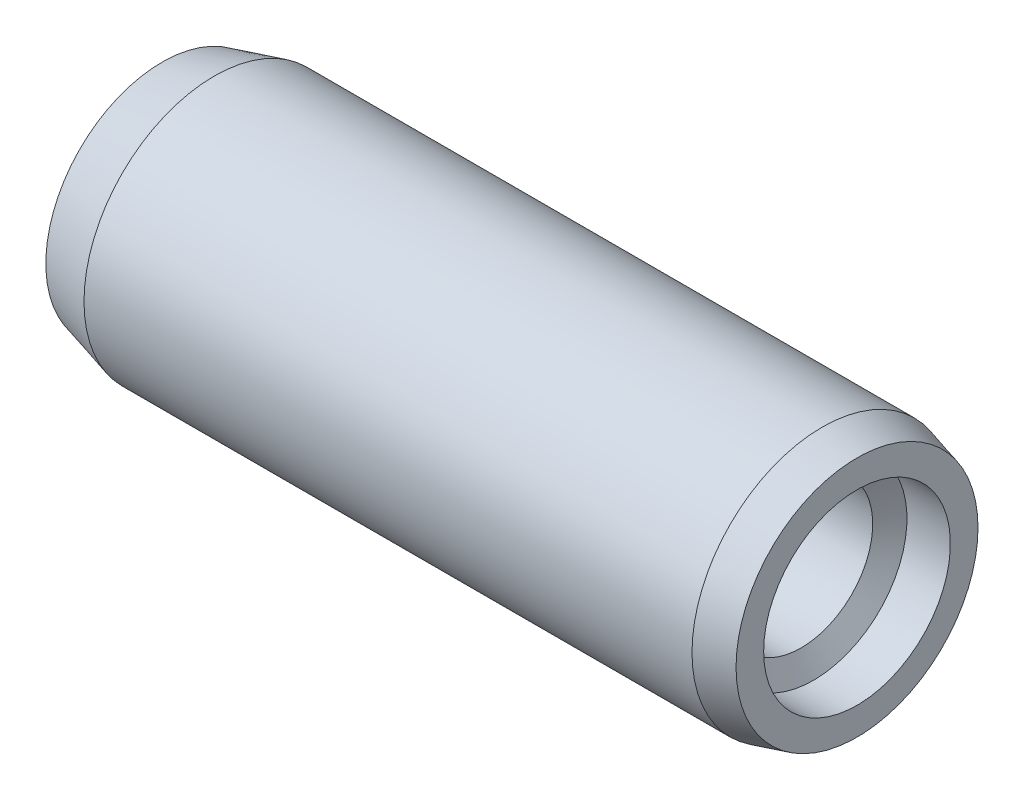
ISO-10303-21;
HEADER;
FILE_DESCRIPTION(('STEP AP214'),'2;1');
FILE_NAME('part.step','',(''),(''),'','','');
FILE_SCHEMA(('AUTOMOTIVE_DESIGN { 1 0 10303 214 1 1 1 1 }'));
ENDSEC;
DATA;
#1=APPLICATION_CONTEXT('core data for automotive mechanical design processes');
#2=APPLICATION_PROTOCOL_DEFINITION('international standard','automotive_design',2000,#1);
#3=PRODUCT_CONTEXT('',#1,'mechanical');
#4=PRODUCT('Part','Part','',(#3));
#5=PRODUCT_RELATED_PRODUCT_CATEGORY('part','',(#4));
#6=PRODUCT_DEFINITION_FORMATION('','',#4);
#7=PRODUCT_DEFINITION_CONTEXT('part definition',#1,'design');
#8=PRODUCT_DEFINITION('design','',#6,#7);
#9=PRODUCT_DEFINITION_SHAPE('','',#8);
#10=(LENGTH_UNIT() NAMED_UNIT(*) SI_UNIT(.MILLI.,.METRE.));
#11=(NAMED_UNIT(*) PLANE_ANGLE_UNIT() SI_UNIT($,.RADIAN.));
#12=(NAMED_UNIT(*) SI_UNIT($,.STERADIAN.) SOLID_ANGLE_UNIT());
#13=UNCERTAINTY_MEASURE_WITH_UNIT(LENGTH_MEASURE(1.E-05),#10,'distance_accuracy_value','');
#14=(GEOMETRIC_REPRESENTATION_CONTEXT(3) GLOBAL_UNCERTAINTY_ASSIGNED_CONTEXT((#13)) GLOBAL_UNIT_ASSIGNED_CONTEXT((#10,
#11,#12)) REPRESENTATION_CONTEXT('',''));
#15=CARTESIAN_POINT('',(0.,0.,0.));
#16=DIRECTION('',(0.,0.,1.));
#17=DIRECTION('',(1.,0.,0.));
#18=AXIS2_PLACEMENT_3D('',#15,#16,#17);
#19=CARTESIAN_POINT('',(16.,2.78564064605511,0.));
#20=DIRECTION('',(1.,0.,0.));
#21=DIRECTION('',(0.,0.,-1.));
#22=AXIS2_PLACEMENT_3D('',#19,#20,#21);
#23=PLANE('',#22);
#24=CARTESIAN_POINT('',(16.,0.,0.));
#25=DIRECTION('',(1.,0.,0.));
#26=DIRECTION('',(0.,0.,-1.));
#27=AXIS2_PLACEMENT_3D('',#24,#25,#26);
#28=CIRCLE('',#27,2.78564064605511);
#29=CARTESIAN_POINT('',(16.,0.,-2.78564064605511));
#30=VERTEX_POINT('',#29);
#31=EDGE_CURVE('E64',#30,#30,#28,.T.);
#32=ORIENTED_EDGE('',*,*,#31,.T.);
#33=EDGE_LOOP('',(#32));
#34=FACE_BOUND('',#33,.T.);
#35=CARTESIAN_POINT('',(16.,0.,0.));
#36=DIRECTION('',(-1.,0.,0.));
#37=DIRECTION('',(0.,0.,1.));
#38=AXIS2_PLACEMENT_3D('',#35,#36,#37);
#39=CIRCLE('',#38,2.15);
#40=CARTESIAN_POINT('',(16.,0.,2.15));
#41=VERTEX_POINT('',#40);
#42=EDGE_CURVE('E61',#41,#41,#39,.T.);
#43=ORIENTED_EDGE('',*,*,#42,.T.);
#44=EDGE_LOOP('',(#43));
#45=FACE_BOUND('',#44,.T.);
#46=ADVANCED_FACE('F34',(#34,#45),#23,.T.);
#47=CARTESIAN_POINT('',(0.,0.,0.));
#48=DIRECTION('',(-1.,0.,0.));
#49=DIRECTION('',(0.,0.,1.));
#50=AXIS2_PLACEMENT_3D('',#47,#48,#49);
#51=PLANE('',#50);
#52=CARTESIAN_POINT('',(0.,0.,0.));
#53=DIRECTION('',(1.,0.,0.));
#54=DIRECTION('',(0.,0.,-1.));
#55=AXIS2_PLACEMENT_3D('',#52,#53,#54);
#56=CIRCLE('',#55,2.67846096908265);
#57=CARTESIAN_POINT('',(0.,0.,-2.67846096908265));
#58=VERTEX_POINT('',#57);
#59=EDGE_CURVE('E11',#58,#58,#56,.T.);
#60=ORIENTED_EDGE('',*,*,#59,.F.);
#61=EDGE_LOOP('',(#60));
#62=FACE_BOUND('',#61,.T.);
#63=ADVANCED_FACE('F36',(#62),#51,.T.);
#64=CARTESIAN_POINT('',(1.2,0.,0.));
#65=DIRECTION('',(1.,0.,0.));
#66=DIRECTION('',(0.,0.,-1.));
#67=AXIS2_PLACEMENT_3D('',#64,#65,#66);
#68=CONICAL_SURFACE('',#67,3.,0.26179938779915);
#69=ORIENTED_EDGE('',*,*,#59,.T.);
#70=EDGE_LOOP('',(#69));
#71=FACE_BOUND('',#70,.T.);
#72=CARTESIAN_POINT('',(1.2,0.,0.));
#73=DIRECTION('',(1.,0.,0.));
#74=DIRECTION('',(0.,0.,-1.));
#75=AXIS2_PLACEMENT_3D('',#72,#73,#74);
#76=CIRCLE('',#75,3.);
#77=CARTESIAN_POINT('',(1.2,0.,-3.));
#78=VERTEX_POINT('',#77);
#79=EDGE_CURVE('E41',#78,#78,#76,.T.);
#80=ORIENTED_EDGE('',*,*,#79,.F.);
#81=EDGE_LOOP('',(#80));
#82=FACE_BOUND('',#81,.T.);
#83=ADVANCED_FACE('F75',(#71,#82),#68,.T.);
#84=CARTESIAN_POINT('',(0.,0.,0.));
#85=DIRECTION('',(1.,0.,0.));
#86=DIRECTION('',(0.,0.,-1.));
#87=AXIS2_PLACEMENT_3D('',#84,#85,#86);
#88=CYLINDRICAL_SURFACE('',#87,3.);
#89=ORIENTED_EDGE('',*,*,#79,.T.);
#90=EDGE_LOOP('',(#89));
#91=FACE_BOUND('',#90,.T.);
#92=CARTESIAN_POINT('',(15.2,0.,0.));
#93=DIRECTION('',(1.,0.,0.));
#94=DIRECTION('',(0.,0.,-1.));
#95=AXIS2_PLACEMENT_3D('',#92,#93,#94);
#96=CIRCLE('',#95,3.);
#97=CARTESIAN_POINT('',(15.2,0.,-3.));
#98=VERTEX_POINT('',#97);
#99=EDGE_CURVE('E67',#98,#98,#96,.T.);
#100=ORIENTED_EDGE('',*,*,#99,.F.);
#101=EDGE_LOOP('',(#100));
#102=FACE_BOUND('',#101,.T.);
#103=ADVANCED_FACE('F72',(#91,#102),#88,.T.);
#104=CARTESIAN_POINT('',(16.,0.,0.));
#105=DIRECTION('',(-1.,0.,0.));
#106=DIRECTION('',(0.,0.,1.));
#107=AXIS2_PLACEMENT_3D('',#104,#105,#106);
#108=CONICAL_SURFACE('',#107,2.78564064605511,0.261799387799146);
#109=ORIENTED_EDGE('',*,*,#99,.T.);
#110=EDGE_LOOP('',(#109));
#111=FACE_BOUND('',#110,.T.);
#112=ORIENTED_EDGE('',*,*,#31,.F.);
#113=EDGE_LOOP('',(#112));
#114=FACE_BOUND('',#113,.T.);
#115=ADVANCED_FACE('F82',(#111,#114),#108,.T.);
#116=CARTESIAN_POINT('',(16.,0.,0.));
#117=DIRECTION('',(-1.,0.,0.));
#118=DIRECTION('',(0.,0.,1.));
#119=AXIS2_PLACEMENT_3D('',#116,#117,#118);
#120=CYLINDRICAL_SURFACE('',#119,2.15);
#121=CARTESIAN_POINT('',(15.,0.,0.));
#122=DIRECTION('',(-1.,0.,0.));
#123=DIRECTION('',(0.,0.,1.));
#124=AXIS2_PLACEMENT_3D('',#121,#122,#123);
#125=CIRCLE('',#124,2.15);
#126=CARTESIAN_POINT('',(15.,0.,2.15));
#127=VERTEX_POINT('',#126);
#128=EDGE_CURVE('E56',#127,#127,#125,.T.);
#129=ORIENTED_EDGE('',*,*,#128,.T.);
#130=EDGE_LOOP('',(#129));
#131=FACE_BOUND('',#130,.T.);
#132=ORIENTED_EDGE('',*,*,#42,.F.);
#133=EDGE_LOOP('',(#132));
#134=FACE_BOUND('',#133,.T.);
#135=ADVANCED_FACE('F93',(#131,#134),#120,.F.);
#136=CARTESIAN_POINT('',(15.,0.,0.));
#137=DIRECTION('',(1.,0.,0.));
#138=DIRECTION('',(0.,0.,-1.));
#139=AXIS2_PLACEMENT_3D('',#136,#137,#138);
#140=CONICAL_SURFACE('',#139,2.15,1.04719755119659);
#141=CARTESIAN_POINT('',(14.7113248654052,0.,0.));
#142=DIRECTION('',(-1.,0.,0.));
#143=DIRECTION('',(0.,0.,1.));
#144=AXIS2_PLACEMENT_3D('',#141,#142,#143);
#145=CIRCLE('',#144,1.65);
#146=CARTESIAN_POINT('',(14.7113248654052,0.,1.65));
#147=VERTEX_POINT('',#146);
#148=EDGE_CURVE('E53',#147,#147,#145,.T.);
#149=ORIENTED_EDGE('',*,*,#148,.T.);
#150=EDGE_LOOP('',(#149));
#151=FACE_BOUND('',#150,.T.);
#152=ORIENTED_EDGE('',*,*,#128,.F.);
#153=EDGE_LOOP('',(#152));
#154=FACE_BOUND('',#153,.T.);
#155=ADVANCED_FACE('F100',(#151,#154),#140,.F.);
#156=CARTESIAN_POINT('',(16.,0.,0.));
#157=DIRECTION('',(-1.,0.,0.));
#158=DIRECTION('',(0.,0.,1.));
#159=AXIS2_PLACEMENT_3D('',#156,#157,#158);
#160=CYLINDRICAL_SURFACE('',#159,1.65);
#161=CARTESIAN_POINT('',(6.00000000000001,0.,0.));
#162=DIRECTION('',(-1.,0.,0.));
#163=DIRECTION('',(0.,0.,1.));
#164=AXIS2_PLACEMENT_3D('',#161,#162,#163);
#165=CIRCLE('',#164,1.65);
#166=CARTESIAN_POINT('',(6.00000000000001,0.,1.65));
#167=VERTEX_POINT('',#166);
#168=EDGE_CURVE('E51',#167,#167,#165,.T.);
#169=ORIENTED_EDGE('',*,*,#168,.T.);
#170=EDGE_LOOP('',(#169));
#171=FACE_BOUND('',#170,.T.);
#172=ORIENTED_EDGE('',*,*,#148,.F.);
#173=EDGE_LOOP('',(#172));
#174=FACE_BOUND('',#173,.T.);
#175=ADVANCED_FACE('F47',(#171,#174),#160,.F.);
#176=CARTESIAN_POINT('',(6.00000000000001,0.,0.));
#177=DIRECTION('',(1.,0.,0.));
#178=DIRECTION('',(0.,0.,-1.));
#179=AXIS2_PLACEMENT_3D('',#176,#177,#178);
#180=CONICAL_SURFACE('',#179,1.65,1.04719755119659);
#181=CARTESIAN_POINT('',(5.04737205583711,0.,0.));
#182=VERTEX_POINT('',#181);
#183=VERTEX_LOOP('',#182);
#184=FACE_BOUND('',#183,.T.);
#185=ORIENTED_EDGE('',*,*,#168,.F.);
#186=EDGE_LOOP('',(#185));
#187=FACE_BOUND('',#186,.T.);
#188=ADVANCED_FACE('F44',(#184,#187),#180,.F.);
#189=CLOSED_SHELL('',(#46,#63,#83,#103,#115,#135,#155,#175,#188));
#190=MANIFOLD_SOLID_BREP('B2',#189);
#191=ADVANCED_BREP_SHAPE_REPRESENTATION('',(#18,#190),#14);
#192=SHAPE_DEFINITION_REPRESENTATION(#9,#191);
ENDSEC;
END-ISO-10303-21;
